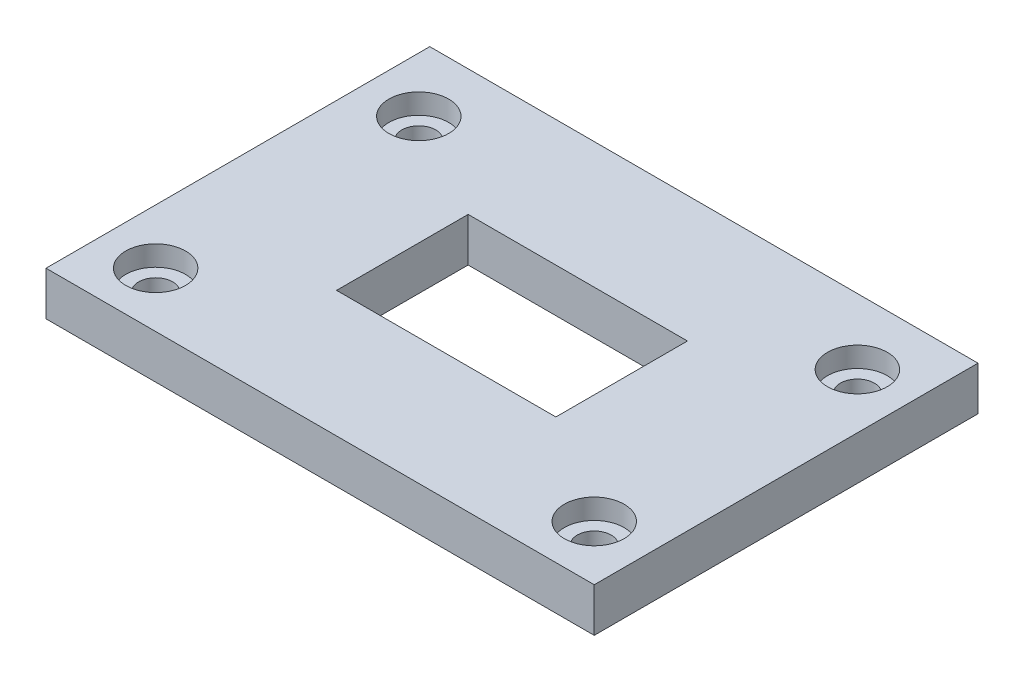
ISO-10303-21;
HEADER;
FILE_DESCRIPTION(('STEP AP214'),'2;1');
FILE_NAME('part.step','',(''),(''),'','','');
FILE_SCHEMA(('AUTOMOTIVE_DESIGN { 1 0 10303 214 1 1 1 1 }'));
ENDSEC;
DATA;
#1=APPLICATION_CONTEXT('core data for automotive mechanical design processes');
#2=APPLICATION_PROTOCOL_DEFINITION('international standard','automotive_design',2000,#1);
#3=PRODUCT_CONTEXT('',#1,'mechanical');
#4=PRODUCT('Part','Part','',(#3));
#5=PRODUCT_RELATED_PRODUCT_CATEGORY('part','',(#4));
#6=PRODUCT_DEFINITION_FORMATION('','',#4);
#7=PRODUCT_DEFINITION_CONTEXT('part definition',#1,'design');
#8=PRODUCT_DEFINITION('design','',#6,#7);
#9=PRODUCT_DEFINITION_SHAPE('','',#8);
#10=(LENGTH_UNIT() NAMED_UNIT(*) SI_UNIT(.MILLI.,.METRE.));
#11=(NAMED_UNIT(*) PLANE_ANGLE_UNIT() SI_UNIT($,.RADIAN.));
#12=(NAMED_UNIT(*) SI_UNIT($,.STERADIAN.) SOLID_ANGLE_UNIT());
#13=UNCERTAINTY_MEASURE_WITH_UNIT(LENGTH_MEASURE(1.E-05),#10,'distance_accuracy_value','');
#14=(GEOMETRIC_REPRESENTATION_CONTEXT(3) GLOBAL_UNCERTAINTY_ASSIGNED_CONTEXT((#13)) GLOBAL_UNIT_ASSIGNED_CONTEXT((#10,
#11,#12)) REPRESENTATION_CONTEXT('',''));
#15=CARTESIAN_POINT('',(0.,0.,0.));
#16=DIRECTION('',(0.,0.,1.));
#17=DIRECTION('',(1.,0.,0.));
#18=AXIS2_PLACEMENT_3D('',#15,#16,#17);
#19=CARTESIAN_POINT('',(-125.,20.,-87.5));
#20=DIRECTION('',(1.,0.,0.));
#21=DIRECTION('',(0.,0.,-1.));
#22=AXIS2_PLACEMENT_3D('',#19,#20,#21);
#23=PLANE('',#22);
#24=DIRECTION('',(0.,0.,1.));
#25=VECTOR('',#24,1.);
#26=CARTESIAN_POINT('',(-125.,0.,-87.5));
#27=LINE('',#26,#25);
#28=CARTESIAN_POINT('',(-125.,0.,-87.5));
#29=VERTEX_POINT('',#28);
#30=CARTESIAN_POINT('',(-125.,0.,87.5));
#31=VERTEX_POINT('',#30);
#32=EDGE_CURVE('E182',#29,#31,#27,.T.);
#33=ORIENTED_EDGE('',*,*,#32,.T.);
#34=DIRECTION('',(0.,-1.,0.));
#35=VECTOR('',#34,1.);
#36=CARTESIAN_POINT('',(-125.,20.,87.5));
#37=LINE('',#36,#35);
#38=CARTESIAN_POINT('',(-125.,20.,87.5));
#39=VERTEX_POINT('',#38);
#40=EDGE_CURVE('E11',#39,#31,#37,.T.);
#41=ORIENTED_EDGE('',*,*,#40,.F.);
#42=DIRECTION('',(0.,0.,1.));
#43=VECTOR('',#42,1.);
#44=CARTESIAN_POINT('',(-125.,20.,-87.5));
#45=LINE('',#44,#43);
#46=CARTESIAN_POINT('',(-125.,20.,-87.5));
#47=VERTEX_POINT('',#46);
#48=EDGE_CURVE('E191',#47,#39,#45,.T.);
#49=ORIENTED_EDGE('',*,*,#48,.F.);
#50=DIRECTION('',(0.,-1.,0.));
#51=VECTOR('',#50,1.);
#52=CARTESIAN_POINT('',(-125.,20.,-87.5));
#53=LINE('',#52,#51);
#54=EDGE_CURVE('E200',#47,#29,#53,.T.);
#55=ORIENTED_EDGE('',*,*,#54,.T.);
#56=EDGE_LOOP('',(#33,#41,#49,#55));
#57=FACE_BOUND('',#56,.T.);
#58=ADVANCED_FACE('F34',(#57),#23,.F.);
#59=CARTESIAN_POINT('',(-125.,20.,87.5));
#60=DIRECTION('',(0.,0.,-1.));
#61=DIRECTION('',(-1.,0.,0.));
#62=AXIS2_PLACEMENT_3D('',#59,#60,#61);
#63=PLANE('',#62);
#64=DIRECTION('',(1.,0.,0.));
#65=VECTOR('',#64,1.);
#66=CARTESIAN_POINT('',(-125.,0.,87.5));
#67=LINE('',#66,#65);
#68=CARTESIAN_POINT('',(125.,0.,87.5));
#69=VERTEX_POINT('',#68);
#70=EDGE_CURVE('E185',#31,#69,#67,.T.);
#71=ORIENTED_EDGE('',*,*,#70,.T.);
#72=DIRECTION('',(0.,-1.,0.));
#73=VECTOR('',#72,1.);
#74=CARTESIAN_POINT('',(125.,20.,87.5));
#75=LINE('',#74,#73);
#76=CARTESIAN_POINT('',(125.,20.,87.5));
#77=VERTEX_POINT('',#76);
#78=EDGE_CURVE('E41',#77,#69,#75,.T.);
#79=ORIENTED_EDGE('',*,*,#78,.F.);
#80=DIRECTION('',(1.,0.,0.));
#81=VECTOR('',#80,1.);
#82=CARTESIAN_POINT('',(-125.,20.,87.5));
#83=LINE('',#82,#81);
#84=EDGE_CURVE('E194',#39,#77,#83,.T.);
#85=ORIENTED_EDGE('',*,*,#84,.F.);
#86=ORIENTED_EDGE('',*,*,#40,.T.);
#87=EDGE_LOOP('',(#71,#79,#85,#86));
#88=FACE_BOUND('',#87,.T.);
#89=ADVANCED_FACE('F225',(#88),#63,.F.);
#90=CARTESIAN_POINT('',(125.,20.,-87.5));
#91=DIRECTION('',(-1.,0.,0.));
#92=DIRECTION('',(0.,0.,1.));
#93=AXIS2_PLACEMENT_3D('',#90,#91,#92);
#94=PLANE('',#93);
#95=DIRECTION('',(0.,0.,-1.));
#96=VECTOR('',#95,1.);
#97=CARTESIAN_POINT('',(125.,0.,-87.5));
#98=LINE('',#97,#96);
#99=CARTESIAN_POINT('',(125.,0.,-87.5));
#100=VERTEX_POINT('',#99);
#101=EDGE_CURVE('E187',#69,#100,#98,.T.);
#102=ORIENTED_EDGE('',*,*,#101,.T.);
#103=DIRECTION('',(0.,-1.,0.));
#104=VECTOR('',#103,1.);
#105=CARTESIAN_POINT('',(125.,20.,-87.5));
#106=LINE('',#105,#104);
#107=CARTESIAN_POINT('',(125.,20.,-87.5));
#108=VERTEX_POINT('',#107);
#109=EDGE_CURVE('E203',#108,#100,#106,.T.);
#110=ORIENTED_EDGE('',*,*,#109,.F.);
#111=DIRECTION('',(0.,0.,-1.));
#112=VECTOR('',#111,1.);
#113=CARTESIAN_POINT('',(125.,20.,-87.5));
#114=LINE('',#113,#112);
#115=EDGE_CURVE('E196',#77,#108,#114,.T.);
#116=ORIENTED_EDGE('',*,*,#115,.F.);
#117=ORIENTED_EDGE('',*,*,#78,.T.);
#118=EDGE_LOOP('',(#102,#110,#116,#117));
#119=FACE_BOUND('',#118,.T.);
#120=ADVANCED_FACE('F210',(#119),#94,.F.);
#121=CARTESIAN_POINT('',(-125.,20.,-87.5));
#122=DIRECTION('',(0.,0.,1.));
#123=DIRECTION('',(1.,0.,0.));
#124=AXIS2_PLACEMENT_3D('',#121,#122,#123);
#125=PLANE('',#124);
#126=DIRECTION('',(-1.,0.,0.));
#127=VECTOR('',#126,1.);
#128=CARTESIAN_POINT('',(-125.,0.,-87.5));
#129=LINE('',#128,#127);
#130=EDGE_CURVE('E189',#100,#29,#129,.T.);
#131=ORIENTED_EDGE('',*,*,#130,.T.);
#132=ORIENTED_EDGE('',*,*,#54,.F.);
#133=DIRECTION('',(-1.,0.,0.));
#134=VECTOR('',#133,1.);
#135=CARTESIAN_POINT('',(-125.,20.,-87.5));
#136=LINE('',#135,#134);
#137=EDGE_CURVE('E198',#108,#47,#136,.T.);
#138=ORIENTED_EDGE('',*,*,#137,.F.);
#139=ORIENTED_EDGE('',*,*,#109,.T.);
#140=EDGE_LOOP('',(#131,#132,#138,#139));
#141=FACE_BOUND('',#140,.T.);
#142=ADVANCED_FACE('F219',(#141),#125,.F.);
#143=CARTESIAN_POINT('',(-125.,20.,87.5));
#144=DIRECTION('',(0.,1.,0.));
#145=DIRECTION('',(0.,0.,1.));
#146=AXIS2_PLACEMENT_3D('',#143,#144,#145);
#147=PLANE('',#146);
#148=DIRECTION('',(0.,0.,1.));
#149=VECTOR('',#148,1.);
#150=CARTESIAN_POINT('',(-50.,20.,-30.));
#151=LINE('',#150,#149);
#152=CARTESIAN_POINT('',(-50.,20.,-30.));
#153=VERTEX_POINT('',#152);
#154=CARTESIAN_POINT('',(-50.,20.,30.));
#155=VERTEX_POINT('',#154);
#156=EDGE_CURVE('E48',#153,#155,#151,.T.);
#157=ORIENTED_EDGE('',*,*,#156,.F.);
#158=DIRECTION('',(-1.,0.,0.));
#159=VECTOR('',#158,1.);
#160=CARTESIAN_POINT('',(-50.,20.,-30.));
#161=LINE('',#160,#159);
#162=CARTESIAN_POINT('',(50.,20.,-30.));
#163=VERTEX_POINT('',#162);
#164=EDGE_CURVE('E116',#163,#153,#161,.T.);
#165=ORIENTED_EDGE('',*,*,#164,.F.);
#166=DIRECTION('',(0.,0.,-1.));
#167=VECTOR('',#166,1.);
#168=CARTESIAN_POINT('',(50.,20.,-30.));
#169=LINE('',#168,#167);
#170=CARTESIAN_POINT('',(50.,20.,30.));
#171=VERTEX_POINT('',#170);
#172=EDGE_CURVE('E100',#171,#163,#169,.T.);
#173=ORIENTED_EDGE('',*,*,#172,.F.);
#174=DIRECTION('',(1.,0.,0.));
#175=VECTOR('',#174,1.);
#176=CARTESIAN_POINT('',(-50.,20.,30.));
#177=LINE('',#176,#175);
#178=EDGE_CURVE('E109',#155,#171,#177,.T.);
#179=ORIENTED_EDGE('',*,*,#178,.F.);
#180=EDGE_LOOP('',(#157,#165,#173,#179));
#181=FACE_BOUND('',#180,.T.);
#182=CARTESIAN_POINT('',(-100.,20.,62.5));
#183=DIRECTION('',(0.,1.,0.));
#184=DIRECTION('',(0.,0.,1.));
#185=AXIS2_PLACEMENT_3D('',#182,#183,#184);
#186=CIRCLE('',#185,13.625);
#187=CARTESIAN_POINT('',(-100.,20.,76.125));
#188=VERTEX_POINT('',#187);
#189=EDGE_CURVE('E143',#188,#188,#186,.T.);
#190=ORIENTED_EDGE('',*,*,#189,.F.);
#191=EDGE_LOOP('',(#190));
#192=FACE_BOUND('',#191,.T.);
#193=CARTESIAN_POINT('',(-100.,20.,-57.5));
#194=DIRECTION('',(0.,1.,0.));
#195=DIRECTION('',(0.,0.,1.));
#196=AXIS2_PLACEMENT_3D('',#193,#194,#195);
#197=CIRCLE('',#196,13.625);
#198=CARTESIAN_POINT('',(-100.,20.,-43.875));
#199=VERTEX_POINT('',#198);
#200=EDGE_CURVE('E155',#199,#199,#197,.T.);
#201=ORIENTED_EDGE('',*,*,#200,.F.);
#202=EDGE_LOOP('',(#201));
#203=FACE_BOUND('',#202,.T.);
#204=CARTESIAN_POINT('',(100.,20.,62.5));
#205=DIRECTION('',(0.,1.,0.));
#206=DIRECTION('',(0.,0.,1.));
#207=AXIS2_PLACEMENT_3D('',#204,#205,#206);
#208=CIRCLE('',#207,13.625);
#209=CARTESIAN_POINT('',(100.,20.,76.125));
#210=VERTEX_POINT('',#209);
#211=EDGE_CURVE('E167',#210,#210,#208,.T.);
#212=ORIENTED_EDGE('',*,*,#211,.F.);
#213=EDGE_LOOP('',(#212));
#214=FACE_BOUND('',#213,.T.);
#215=CARTESIAN_POINT('',(100.,20.,-57.5));
#216=DIRECTION('',(0.,1.,0.));
#217=DIRECTION('',(0.,0.,1.));
#218=AXIS2_PLACEMENT_3D('',#215,#216,#217);
#219=CIRCLE('',#218,13.625);
#220=CARTESIAN_POINT('',(100.,20.,-43.875));
#221=VERTEX_POINT('',#220);
#222=EDGE_CURVE('E179',#221,#221,#219,.T.);
#223=ORIENTED_EDGE('',*,*,#222,.F.);
#224=EDGE_LOOP('',(#223));
#225=FACE_BOUND('',#224,.T.);
#226=ORIENTED_EDGE('',*,*,#48,.T.);
#227=ORIENTED_EDGE('',*,*,#84,.T.);
#228=ORIENTED_EDGE('',*,*,#115,.T.);
#229=ORIENTED_EDGE('',*,*,#137,.T.);
#230=EDGE_LOOP('',(#226,#227,#228,#229));
#231=FACE_BOUND('',#230,.T.);
#232=ADVANCED_FACE('F113',(#181,#192,#203,#214,#225,#231),#147,.T.);
#233=CARTESIAN_POINT('',(-125.,0.,87.5));
#234=DIRECTION('',(0.,1.,0.));
#235=DIRECTION('',(0.,0.,1.));
#236=AXIS2_PLACEMENT_3D('',#233,#234,#235);
#237=PLANE('',#236);
#238=DIRECTION('',(-1.,0.,0.));
#239=VECTOR('',#238,1.);
#240=CARTESIAN_POINT('',(-50.,0.,-30.));
#241=LINE('',#240,#239);
#242=CARTESIAN_POINT('',(50.,0.,-30.));
#243=VERTEX_POINT('',#242);
#244=CARTESIAN_POINT('',(-50.,0.,-30.));
#245=VERTEX_POINT('',#244);
#246=EDGE_CURVE('E127',#243,#245,#241,.T.);
#247=ORIENTED_EDGE('',*,*,#246,.T.);
#248=DIRECTION('',(0.,0.,1.));
#249=VECTOR('',#248,1.);
#250=CARTESIAN_POINT('',(-50.,0.,-30.));
#251=LINE('',#250,#249);
#252=CARTESIAN_POINT('',(-50.,0.,30.));
#253=VERTEX_POINT('',#252);
#254=EDGE_CURVE('E118',#245,#253,#251,.T.);
#255=ORIENTED_EDGE('',*,*,#254,.T.);
#256=DIRECTION('',(1.,0.,0.));
#257=VECTOR('',#256,1.);
#258=CARTESIAN_POINT('',(-50.,0.,30.));
#259=LINE('',#258,#257);
#260=CARTESIAN_POINT('',(50.,0.,30.));
#261=VERTEX_POINT('',#260);
#262=EDGE_CURVE('E124',#253,#261,#259,.T.);
#263=ORIENTED_EDGE('',*,*,#262,.T.);
#264=DIRECTION('',(0.,0.,-1.));
#265=VECTOR('',#264,1.);
#266=CARTESIAN_POINT('',(50.,0.,-30.));
#267=LINE('',#266,#265);
#268=EDGE_CURVE('E56',#261,#243,#267,.T.);
#269=ORIENTED_EDGE('',*,*,#268,.T.);
#270=EDGE_LOOP('',(#247,#255,#263,#269));
#271=FACE_BOUND('',#270,.T.);
#272=CARTESIAN_POINT('',(-100.,0.,62.5));
#273=DIRECTION('',(0.,1.,0.));
#274=DIRECTION('',(0.,0.,1.));
#275=AXIS2_PLACEMENT_3D('',#272,#273,#274);
#276=CIRCLE('',#275,7.74999999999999);
#277=CARTESIAN_POINT('',(-100.,0.,70.25));
#278=VERTEX_POINT('',#277);
#279=EDGE_CURVE('E132',#278,#278,#276,.T.);
#280=ORIENTED_EDGE('',*,*,#279,.T.);
#281=EDGE_LOOP('',(#280));
#282=FACE_BOUND('',#281,.T.);
#283=CARTESIAN_POINT('',(-100.,0.,-57.5));
#284=DIRECTION('',(0.,1.,0.));
#285=DIRECTION('',(0.,0.,1.));
#286=AXIS2_PLACEMENT_3D('',#283,#284,#285);
#287=CIRCLE('',#286,7.74999999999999);
#288=CARTESIAN_POINT('',(-100.,0.,-49.75));
#289=VERTEX_POINT('',#288);
#290=EDGE_CURVE('E146',#289,#289,#287,.T.);
#291=ORIENTED_EDGE('',*,*,#290,.T.);
#292=EDGE_LOOP('',(#291));
#293=FACE_BOUND('',#292,.T.);
#294=CARTESIAN_POINT('',(100.,0.,62.5));
#295=DIRECTION('',(0.,1.,0.));
#296=DIRECTION('',(0.,0.,1.));
#297=AXIS2_PLACEMENT_3D('',#294,#295,#296);
#298=CIRCLE('',#297,7.74999999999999);
#299=CARTESIAN_POINT('',(100.,0.,70.25));
#300=VERTEX_POINT('',#299);
#301=EDGE_CURVE('E158',#300,#300,#298,.T.);
#302=ORIENTED_EDGE('',*,*,#301,.T.);
#303=EDGE_LOOP('',(#302));
#304=FACE_BOUND('',#303,.T.);
#305=CARTESIAN_POINT('',(100.,0.,-57.5));
#306=DIRECTION('',(0.,1.,0.));
#307=DIRECTION('',(0.,0.,1.));
#308=AXIS2_PLACEMENT_3D('',#305,#306,#307);
#309=CIRCLE('',#308,7.74999999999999);
#310=CARTESIAN_POINT('',(100.,0.,-49.75));
#311=VERTEX_POINT('',#310);
#312=EDGE_CURVE('E170',#311,#311,#309,.T.);
#313=ORIENTED_EDGE('',*,*,#312,.T.);
#314=EDGE_LOOP('',(#313));
#315=FACE_BOUND('',#314,.T.);
#316=ORIENTED_EDGE('',*,*,#32,.F.);
#317=ORIENTED_EDGE('',*,*,#130,.F.);
#318=ORIENTED_EDGE('',*,*,#101,.F.);
#319=ORIENTED_EDGE('',*,*,#70,.F.);
#320=EDGE_LOOP('',(#316,#317,#318,#319));
#321=FACE_BOUND('',#320,.T.);
#322=ADVANCED_FACE('F216',(#271,#282,#293,#304,#315,#321),#237,.F.);
#323=CARTESIAN_POINT('',(100.,20.,-57.5));
#324=DIRECTION('',(0.,1.,0.));
#325=DIRECTION('',(0.,0.,1.));
#326=AXIS2_PLACEMENT_3D('',#323,#324,#325);
#327=CYLINDRICAL_SURFACE('',#326,13.625);
#328=CARTESIAN_POINT('',(100.,10.75,-57.5));
#329=DIRECTION('',(0.,1.,0.));
#330=DIRECTION('',(0.,0.,1.));
#331=AXIS2_PLACEMENT_3D('',#328,#329,#330);
#332=CIRCLE('',#331,13.625);
#333=CARTESIAN_POINT('',(100.,10.75,-43.875));
#334=VERTEX_POINT('',#333);
#335=EDGE_CURVE('E176',#334,#334,#332,.T.);
#336=ORIENTED_EDGE('',*,*,#335,.F.);
#337=EDGE_LOOP('',(#336));
#338=FACE_BOUND('',#337,.T.);
#339=ORIENTED_EDGE('',*,*,#222,.T.);
#340=EDGE_LOOP('',(#339));
#341=FACE_BOUND('',#340,.T.);
#342=ADVANCED_FACE('F239',(#338,#341),#327,.F.);
#343=CARTESIAN_POINT('',(107.75,10.75,-57.5));
#344=DIRECTION('',(0.,-1.,0.));
#345=DIRECTION('',(0.,0.,-1.));
#346=AXIS2_PLACEMENT_3D('',#343,#344,#345);
#347=PLANE('',#346);
#348=CARTESIAN_POINT('',(100.,10.75,-57.5));
#349=DIRECTION('',(0.,1.,0.));
#350=DIRECTION('',(0.,0.,1.));
#351=AXIS2_PLACEMENT_3D('',#348,#349,#350);
#352=CIRCLE('',#351,7.74999999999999);
#353=CARTESIAN_POINT('',(100.,10.75,-49.75));
#354=VERTEX_POINT('',#353);
#355=EDGE_CURVE('E173',#354,#354,#352,.T.);
#356=ORIENTED_EDGE('',*,*,#355,.F.);
#357=EDGE_LOOP('',(#356));
#358=FACE_BOUND('',#357,.T.);
#359=ORIENTED_EDGE('',*,*,#335,.T.);
#360=EDGE_LOOP('',(#359));
#361=FACE_BOUND('',#360,.T.);
#362=ADVANCED_FACE('F243',(#358,#361),#347,.F.);
#363=CARTESIAN_POINT('',(100.,20.,-57.5));
#364=DIRECTION('',(0.,1.,0.));
#365=DIRECTION('',(0.,0.,1.));
#366=AXIS2_PLACEMENT_3D('',#363,#364,#365);
#367=CYLINDRICAL_SURFACE('',#366,7.74999999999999);
#368=ORIENTED_EDGE('',*,*,#312,.F.);
#369=EDGE_LOOP('',(#368));
#370=FACE_BOUND('',#369,.T.);
#371=ORIENTED_EDGE('',*,*,#355,.T.);
#372=EDGE_LOOP('',(#371));
#373=FACE_BOUND('',#372,.T.);
#374=ADVANCED_FACE('F247',(#370,#373),#367,.F.);
#375=CARTESIAN_POINT('',(100.,20.,62.5));
#376=DIRECTION('',(0.,1.,0.));
#377=DIRECTION('',(0.,0.,1.));
#378=AXIS2_PLACEMENT_3D('',#375,#376,#377);
#379=CYLINDRICAL_SURFACE('',#378,13.625);
#380=CARTESIAN_POINT('',(100.,10.75,62.5));
#381=DIRECTION('',(0.,1.,0.));
#382=DIRECTION('',(0.,0.,1.));
#383=AXIS2_PLACEMENT_3D('',#380,#381,#382);
#384=CIRCLE('',#383,13.625);
#385=CARTESIAN_POINT('',(100.,10.75,76.125));
#386=VERTEX_POINT('',#385);
#387=EDGE_CURVE('E164',#386,#386,#384,.T.);
#388=ORIENTED_EDGE('',*,*,#387,.F.);
#389=EDGE_LOOP('',(#388));
#390=FACE_BOUND('',#389,.T.);
#391=ORIENTED_EDGE('',*,*,#211,.T.);
#392=EDGE_LOOP('',(#391));
#393=FACE_BOUND('',#392,.T.);
#394=ADVANCED_FACE('F251',(#390,#393),#379,.F.);
#395=CARTESIAN_POINT('',(107.75,10.75,62.5));
#396=DIRECTION('',(0.,-1.,0.));
#397=DIRECTION('',(0.,0.,-1.));
#398=AXIS2_PLACEMENT_3D('',#395,#396,#397);
#399=PLANE('',#398);
#400=CARTESIAN_POINT('',(100.,10.75,62.5));
#401=DIRECTION('',(0.,1.,0.));
#402=DIRECTION('',(0.,0.,1.));
#403=AXIS2_PLACEMENT_3D('',#400,#401,#402);
#404=CIRCLE('',#403,7.74999999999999);
#405=CARTESIAN_POINT('',(100.,10.75,70.25));
#406=VERTEX_POINT('',#405);
#407=EDGE_CURVE('E161',#406,#406,#404,.T.);
#408=ORIENTED_EDGE('',*,*,#407,.F.);
#409=EDGE_LOOP('',(#408));
#410=FACE_BOUND('',#409,.T.);
#411=ORIENTED_EDGE('',*,*,#387,.T.);
#412=EDGE_LOOP('',(#411));
#413=FACE_BOUND('',#412,.T.);
#414=ADVANCED_FACE('F255',(#410,#413),#399,.F.);
#415=CARTESIAN_POINT('',(100.,20.,62.5));
#416=DIRECTION('',(0.,1.,0.));
#417=DIRECTION('',(0.,0.,1.));
#418=AXIS2_PLACEMENT_3D('',#415,#416,#417);
#419=CYLINDRICAL_SURFACE('',#418,7.74999999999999);
#420=ORIENTED_EDGE('',*,*,#301,.F.);
#421=EDGE_LOOP('',(#420));
#422=FACE_BOUND('',#421,.T.);
#423=ORIENTED_EDGE('',*,*,#407,.T.);
#424=EDGE_LOOP('',(#423));
#425=FACE_BOUND('',#424,.T.);
#426=ADVANCED_FACE('F259',(#422,#425),#419,.F.);
#427=CARTESIAN_POINT('',(-100.,20.,-57.5));
#428=DIRECTION('',(0.,1.,0.));
#429=DIRECTION('',(0.,0.,1.));
#430=AXIS2_PLACEMENT_3D('',#427,#428,#429);
#431=CYLINDRICAL_SURFACE('',#430,13.625);
#432=CARTESIAN_POINT('',(-100.,10.75,-57.5));
#433=DIRECTION('',(0.,1.,0.));
#434=DIRECTION('',(0.,0.,1.));
#435=AXIS2_PLACEMENT_3D('',#432,#433,#434);
#436=CIRCLE('',#435,13.625);
#437=CARTESIAN_POINT('',(-100.,10.75,-43.875));
#438=VERTEX_POINT('',#437);
#439=EDGE_CURVE('E152',#438,#438,#436,.T.);
#440=ORIENTED_EDGE('',*,*,#439,.F.);
#441=EDGE_LOOP('',(#440));
#442=FACE_BOUND('',#441,.T.);
#443=ORIENTED_EDGE('',*,*,#200,.T.);
#444=EDGE_LOOP('',(#443));
#445=FACE_BOUND('',#444,.T.);
#446=ADVANCED_FACE('F263',(#442,#445),#431,.F.);
#447=CARTESIAN_POINT('',(-92.25,10.75,-57.5));
#448=DIRECTION('',(0.,-1.,0.));
#449=DIRECTION('',(0.,0.,-1.));
#450=AXIS2_PLACEMENT_3D('',#447,#448,#449);
#451=PLANE('',#450);
#452=CARTESIAN_POINT('',(-100.,10.75,-57.5));
#453=DIRECTION('',(0.,1.,0.));
#454=DIRECTION('',(0.,0.,1.));
#455=AXIS2_PLACEMENT_3D('',#452,#453,#454);
#456=CIRCLE('',#455,7.74999999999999);
#457=CARTESIAN_POINT('',(-100.,10.75,-49.75));
#458=VERTEX_POINT('',#457);
#459=EDGE_CURVE('E149',#458,#458,#456,.T.);
#460=ORIENTED_EDGE('',*,*,#459,.F.);
#461=EDGE_LOOP('',(#460));
#462=FACE_BOUND('',#461,.T.);
#463=ORIENTED_EDGE('',*,*,#439,.T.);
#464=EDGE_LOOP('',(#463));
#465=FACE_BOUND('',#464,.T.);
#466=ADVANCED_FACE('F267',(#462,#465),#451,.F.);
#467=CARTESIAN_POINT('',(-100.,20.,-57.5));
#468=DIRECTION('',(0.,1.,0.));
#469=DIRECTION('',(0.,0.,1.));
#470=AXIS2_PLACEMENT_3D('',#467,#468,#469);
#471=CYLINDRICAL_SURFACE('',#470,7.74999999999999);
#472=ORIENTED_EDGE('',*,*,#290,.F.);
#473=EDGE_LOOP('',(#472));
#474=FACE_BOUND('',#473,.T.);
#475=ORIENTED_EDGE('',*,*,#459,.T.);
#476=EDGE_LOOP('',(#475));
#477=FACE_BOUND('',#476,.T.);
#478=ADVANCED_FACE('F271',(#474,#477),#471,.F.);
#479=CARTESIAN_POINT('',(-100.,20.,62.5));
#480=DIRECTION('',(0.,1.,0.));
#481=DIRECTION('',(0.,0.,1.));
#482=AXIS2_PLACEMENT_3D('',#479,#480,#481);
#483=CYLINDRICAL_SURFACE('',#482,13.625);
#484=CARTESIAN_POINT('',(-100.,10.75,62.5));
#485=DIRECTION('',(0.,1.,0.));
#486=DIRECTION('',(0.,0.,1.));
#487=AXIS2_PLACEMENT_3D('',#484,#485,#486);
#488=CIRCLE('',#487,13.625);
#489=CARTESIAN_POINT('',(-100.,10.75,76.125));
#490=VERTEX_POINT('',#489);
#491=EDGE_CURVE('E140',#490,#490,#488,.T.);
#492=ORIENTED_EDGE('',*,*,#491,.F.);
#493=EDGE_LOOP('',(#492));
#494=FACE_BOUND('',#493,.T.);
#495=ORIENTED_EDGE('',*,*,#189,.T.);
#496=EDGE_LOOP('',(#495));
#497=FACE_BOUND('',#496,.T.);
#498=ADVANCED_FACE('F275',(#494,#497),#483,.F.);
#499=CARTESIAN_POINT('',(-92.25,10.75,62.5));
#500=DIRECTION('',(0.,-1.,0.));
#501=DIRECTION('',(0.,0.,-1.));
#502=AXIS2_PLACEMENT_3D('',#499,#500,#501);
#503=PLANE('',#502);
#504=CARTESIAN_POINT('',(-100.,10.75,62.5));
#505=DIRECTION('',(0.,1.,0.));
#506=DIRECTION('',(0.,0.,1.));
#507=AXIS2_PLACEMENT_3D('',#504,#505,#506);
#508=CIRCLE('',#507,7.74999999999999);
#509=CARTESIAN_POINT('',(-100.,10.75,70.25));
#510=VERTEX_POINT('',#509);
#511=EDGE_CURVE('E137',#510,#510,#508,.T.);
#512=ORIENTED_EDGE('',*,*,#511,.F.);
#513=EDGE_LOOP('',(#512));
#514=FACE_BOUND('',#513,.T.);
#515=ORIENTED_EDGE('',*,*,#491,.T.);
#516=EDGE_LOOP('',(#515));
#517=FACE_BOUND('',#516,.T.);
#518=ADVANCED_FACE('F279',(#514,#517),#503,.F.);
#519=CARTESIAN_POINT('',(-100.,20.,62.5));
#520=DIRECTION('',(0.,1.,0.));
#521=DIRECTION('',(0.,0.,1.));
#522=AXIS2_PLACEMENT_3D('',#519,#520,#521);
#523=CYLINDRICAL_SURFACE('',#522,7.74999999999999);
#524=ORIENTED_EDGE('',*,*,#279,.F.);
#525=EDGE_LOOP('',(#524));
#526=FACE_BOUND('',#525,.T.);
#527=ORIENTED_EDGE('',*,*,#511,.T.);
#528=EDGE_LOOP('',(#527));
#529=FACE_BOUND('',#528,.T.);
#530=ADVANCED_FACE('F283',(#526,#529),#523,.F.);
#531=CARTESIAN_POINT('',(-50.,0.,-30.));
#532=DIRECTION('',(-1.,0.,0.));
#533=DIRECTION('',(0.,0.,1.));
#534=AXIS2_PLACEMENT_3D('',#531,#532,#533);
#535=PLANE('',#534);
#536=ORIENTED_EDGE('',*,*,#156,.T.);
#537=DIRECTION('',(0.,1.,0.));
#538=VECTOR('',#537,1.);
#539=CARTESIAN_POINT('',(-50.,0.,30.));
#540=LINE('',#539,#538);
#541=EDGE_CURVE('E106',#253,#155,#540,.T.);
#542=ORIENTED_EDGE('',*,*,#541,.F.);
#543=ORIENTED_EDGE('',*,*,#254,.F.);
#544=DIRECTION('',(0.,1.,0.));
#545=VECTOR('',#544,1.);
#546=CARTESIAN_POINT('',(-50.,0.,-30.));
#547=LINE('',#546,#545);
#548=EDGE_CURVE('E130',#245,#153,#547,.T.);
#549=ORIENTED_EDGE('',*,*,#548,.T.);
#550=EDGE_LOOP('',(#536,#542,#543,#549));
#551=FACE_BOUND('',#550,.T.);
#552=ADVANCED_FACE('F287',(#551),#535,.F.);
#553=CARTESIAN_POINT('',(-50.,0.,-30.));
#554=DIRECTION('',(0.,0.,-1.));
#555=DIRECTION('',(-1.,0.,0.));
#556=AXIS2_PLACEMENT_3D('',#553,#554,#555);
#557=PLANE('',#556);
#558=ORIENTED_EDGE('',*,*,#164,.T.);
#559=ORIENTED_EDGE('',*,*,#548,.F.);
#560=ORIENTED_EDGE('',*,*,#246,.F.);
#561=DIRECTION('',(0.,1.,0.));
#562=VECTOR('',#561,1.);
#563=CARTESIAN_POINT('',(50.,0.,-30.));
#564=LINE('',#563,#562);
#565=EDGE_CURVE('E105',#243,#163,#564,.T.);
#566=ORIENTED_EDGE('',*,*,#565,.T.);
#567=EDGE_LOOP('',(#558,#559,#560,#566));
#568=FACE_BOUND('',#567,.T.);
#569=ADVANCED_FACE('F291',(#568),#557,.F.);
#570=CARTESIAN_POINT('',(50.,0.,-30.));
#571=DIRECTION('',(1.,0.,0.));
#572=DIRECTION('',(0.,0.,-1.));
#573=AXIS2_PLACEMENT_3D('',#570,#571,#572);
#574=PLANE('',#573);
#575=ORIENTED_EDGE('',*,*,#172,.T.);
#576=ORIENTED_EDGE('',*,*,#565,.F.);
#577=ORIENTED_EDGE('',*,*,#268,.F.);
#578=DIRECTION('',(0.,1.,0.));
#579=VECTOR('',#578,1.);
#580=CARTESIAN_POINT('',(50.,0.,30.));
#581=LINE('',#580,#579);
#582=EDGE_CURVE('E96',#261,#171,#581,.T.);
#583=ORIENTED_EDGE('',*,*,#582,.T.);
#584=EDGE_LOOP('',(#575,#576,#577,#583));
#585=FACE_BOUND('',#584,.T.);
#586=ADVANCED_FACE('F98',(#585),#574,.F.);
#587=CARTESIAN_POINT('',(-50.,0.,30.));
#588=DIRECTION('',(0.,0.,1.));
#589=DIRECTION('',(1.,0.,0.));
#590=AXIS2_PLACEMENT_3D('',#587,#588,#589);
#591=PLANE('',#590);
#592=ORIENTED_EDGE('',*,*,#178,.T.);
#593=ORIENTED_EDGE('',*,*,#582,.F.);
#594=ORIENTED_EDGE('',*,*,#262,.F.);
#595=ORIENTED_EDGE('',*,*,#541,.T.);
#596=EDGE_LOOP('',(#592,#593,#594,#595));
#597=FACE_BOUND('',#596,.T.);
#598=ADVANCED_FACE('F110',(#597),#591,.F.);
#599=CLOSED_SHELL('',(#58,#89,#120,#142,#232,#322,#342,#362,#374,#394,#414,#426,#446,#466,#478,
#498,#518,#530,#552,#569,#586,#598));
#600=MANIFOLD_SOLID_BREP('B2',#599);
#601=ADVANCED_BREP_SHAPE_REPRESENTATION('',(#18,#600),#14);
#602=SHAPE_DEFINITION_REPRESENTATION(#9,#601);
ENDSEC;
END-ISO-10303-21;
